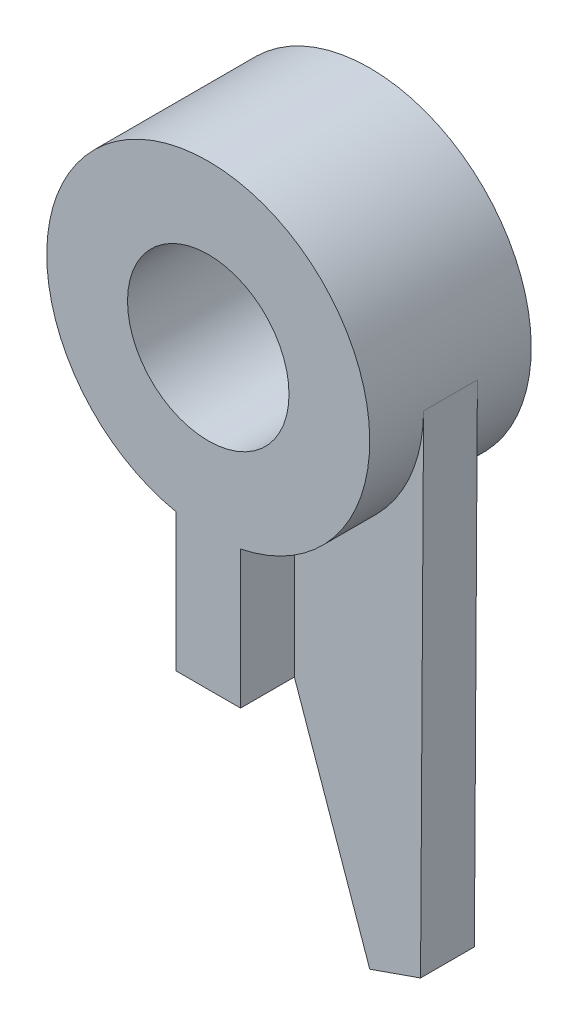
from build123d import *

# Parameters (mm, degrees)
SKETCH_1_R      = 15
EXTRUDE_1_DEPTH = 15
EXTRUDE_2_DEPTH = 5


with BuildPart() as part:
    # Sketch 1 → Extrude 1 (new, symmetric)
    with BuildSketch(Plane.XY):
        with BuildLine():
            Line((-6, -29.393876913), (-6, -55))
            Line((-6, -55), (6, -55))
            Line((6, -55), (6, -29.393876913))
            ThreePointArc((6, -29.393876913), (0, 30), (-6, -29.393876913))
        make_face()
        Circle(SKETCH_1_R, mode=Mode.SUBTRACT)
    extrude(amount=EXTRUDE_1_DEPTH, both=True)

    # Sketch 2 → Extrude 2 (add, symmetric)
    with BuildSketch(Plane.XY):
        with BuildLine():
            Line((6, -55), (6, -29.393876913))
            ThreePointArc((6, -29.393876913), (23.17964989, -19.044784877), (29.999436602, -0.183857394))
            Line((29.999436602, -0.183857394), (29.438583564, -91.696495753))
            Line((29.438583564, -91.696495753), (20, -95))
            Line((20, -95), (6, -55))
        make_face()
    extrude(amount=EXTRUDE_2_DEPTH, both=True)


solid = part.part
